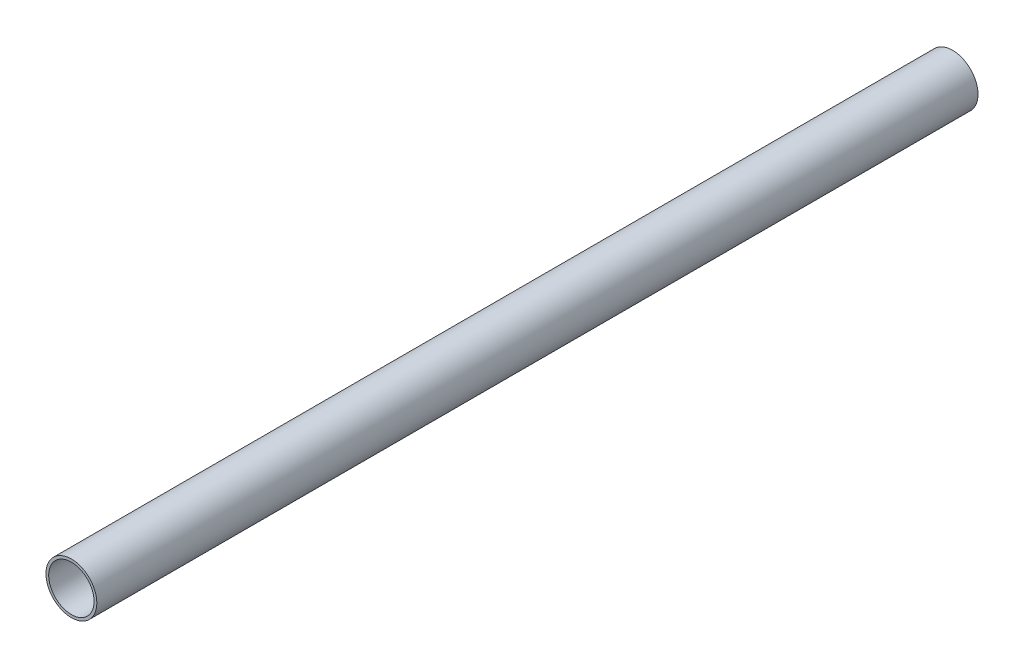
from build123d import *

# Parameters (mm, degrees)
ESQUISSE1_R        = 14
ESQUISSE1_R_2      = 12.5
EXTRU_MINCE1_DEPTH = 485


with BuildPart() as part:
    # Esquisse1 → Extru.-Mince1 (new body)
    with BuildSketch(Plane.XY):
        Circle(ESQUISSE1_R)
        Circle(ESQUISSE1_R_2, mode=Mode.SUBTRACT)
    extrude(amount=EXTRU_MINCE1_DEPTH)


solid = part.part
